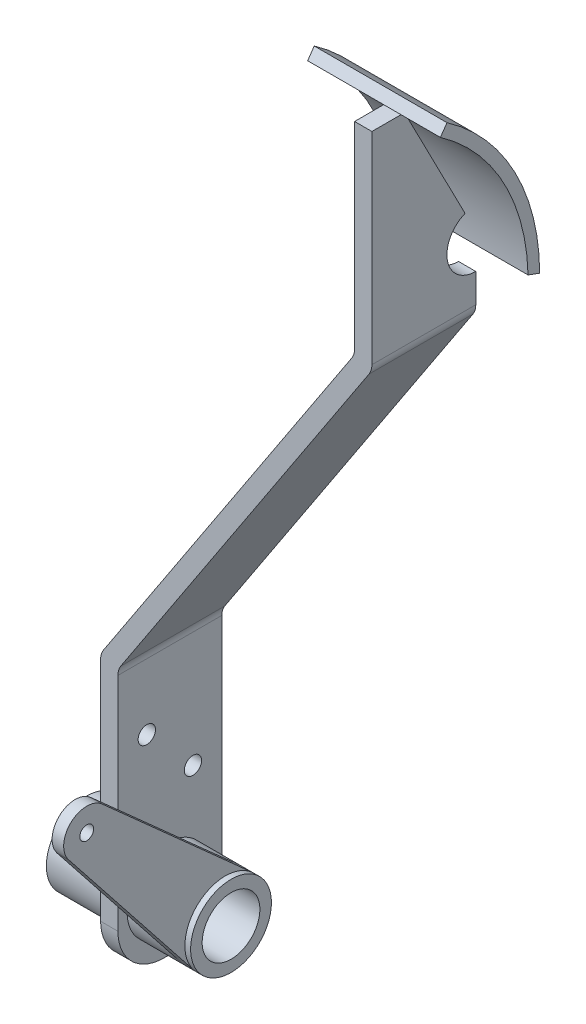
ISO-10303-21;
HEADER;
FILE_DESCRIPTION(('STEP AP214'),'2;1');
FILE_NAME('part.step','',(''),(''),'','','');
FILE_SCHEMA(('AUTOMOTIVE_DESIGN { 1 0 10303 214 1 1 1 1 }'));
ENDSEC;
DATA;
#1=APPLICATION_CONTEXT('core data for automotive mechanical design processes');
#2=APPLICATION_PROTOCOL_DEFINITION('international standard','automotive_design',2000,#1);
#3=PRODUCT_CONTEXT('',#1,'mechanical');
#4=PRODUCT('Part','Part','',(#3));
#5=PRODUCT_RELATED_PRODUCT_CATEGORY('part','',(#4));
#6=PRODUCT_DEFINITION_FORMATION('','',#4);
#7=PRODUCT_DEFINITION_CONTEXT('part definition',#1,'design');
#8=PRODUCT_DEFINITION('design','',#6,#7);
#9=PRODUCT_DEFINITION_SHAPE('','',#8);
#10=(LENGTH_UNIT() NAMED_UNIT(*) SI_UNIT(.MILLI.,.METRE.));
#11=(NAMED_UNIT(*) PLANE_ANGLE_UNIT() SI_UNIT($,.RADIAN.));
#12=(NAMED_UNIT(*) SI_UNIT($,.STERADIAN.) SOLID_ANGLE_UNIT());
#13=UNCERTAINTY_MEASURE_WITH_UNIT(LENGTH_MEASURE(1.E-05),#10,'distance_accuracy_value','');
#14=(GEOMETRIC_REPRESENTATION_CONTEXT(3) GLOBAL_UNCERTAINTY_ASSIGNED_CONTEXT((#13)) GLOBAL_UNIT_ASSIGNED_CONTEXT((#10,
#11,#12)) REPRESENTATION_CONTEXT('',''));
#15=CARTESIAN_POINT('',(0.,0.,0.));
#16=DIRECTION('',(0.,0.,1.));
#17=DIRECTION('',(1.,0.,0.));
#18=AXIS2_PLACEMENT_3D('',#15,#16,#17);
#19=CARTESIAN_POINT('',(57.,124.054513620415,36.4328626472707));
#20=DIRECTION('',(-1.,0.,0.));
#21=DIRECTION('',(0.,0.,1.));
#22=AXIS2_PLACEMENT_3D('',#19,#20,#21);
#23=CYLINDRICAL_SURFACE('',#22,35.5);
#24=DIRECTION('',(-1.,0.,0.));
#25=VECTOR('',#24,1.);
#26=CARTESIAN_POINT('',(57.,153.177217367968,16.1321698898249));
#27=LINE('',#26,#25);
#28=CARTESIAN_POINT('',(57.,153.177217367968,16.1321698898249));
#29=VERTEX_POINT('',#28);
#30=CARTESIAN_POINT('',(34.,153.177217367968,16.1321698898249));
#31=VERTEX_POINT('',#30);
#32=EDGE_CURVE('E98',#29,#31,#27,.T.);
#33=ORIENTED_EDGE('',*,*,#32,.T.);
#34=CARTESIAN_POINT('',(34.,124.054513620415,36.4328626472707));
#35=DIRECTION('',(-1.,0.,0.));
#36=DIRECTION('',(0.,0.,-1.));
#37=AXIS2_PLACEMENT_3D('',#34,#35,#36);
#38=CIRCLE('',#37,35.5);
#39=CARTESIAN_POINT('',(34.,124.938166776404,0.943862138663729));
#40=VERTEX_POINT('',#39);
#41=EDGE_CURVE('E93',#31,#40,#38,.T.);
#42=ORIENTED_EDGE('',*,*,#41,.T.);
#43=DIRECTION('',(-1.,0.,0.));
#44=VECTOR('',#43,1.);
#45=CARTESIAN_POINT('',(57.,124.938166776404,0.943862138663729));
#46=LINE('',#45,#44);
#47=CARTESIAN_POINT('',(57.,124.938166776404,0.943862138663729));
#48=VERTEX_POINT('',#47);
#49=EDGE_CURVE('E12',#48,#40,#46,.T.);
#50=ORIENTED_EDGE('',*,*,#49,.F.);
#51=CARTESIAN_POINT('',(57.,124.054513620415,36.4328626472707));
#52=DIRECTION('',(-1.,0.,0.));
#53=DIRECTION('',(0.,0.,-1.));
#54=AXIS2_PLACEMENT_3D('',#51,#52,#53);
#55=CIRCLE('',#54,35.5);
#56=EDGE_CURVE('E104',#29,#48,#55,.T.);
#57=ORIENTED_EDGE('',*,*,#56,.F.);
#58=EDGE_LOOP('',(#33,#42,#50,#57));
#59=FACE_BOUND('',#58,.T.);
#60=ADVANCED_FACE('F41',(#59),#23,.F.);
#61=CARTESIAN_POINT('',(57.,124.938166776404,0.943862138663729));
#62=DIRECTION('',(0.,0.938562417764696,-0.345109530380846));
#63=DIRECTION('',(0.,0.345109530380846,0.938562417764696));
#64=AXIS2_PLACEMENT_3D('',#61,#62,#63);
#65=PLANE('',#64);
#66=ORIENTED_EDGE('',*,*,#49,.T.);
#67=DIRECTION('',(0.,-0.345109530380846,-0.938562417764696));
#68=VECTOR('',#67,1.);
#69=CARTESIAN_POINT('',(34.,124.938166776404,0.943862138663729));
#70=LINE('',#69,#68);
#71=CARTESIAN_POINT('',(34.,124.198824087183,-1.06685967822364));
#72=VERTEX_POINT('',#71);
#73=EDGE_CURVE('E83',#40,#72,#70,.T.);
#74=ORIENTED_EDGE('',*,*,#73,.T.);
#75=DIRECTION('',(-1.,0.,0.));
#76=VECTOR('',#75,1.);
#77=CARTESIAN_POINT('',(57.,124.198824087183,-1.06685967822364));
#78=LINE('',#77,#76);
#79=CARTESIAN_POINT('',(57.,124.198824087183,-1.06685967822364));
#80=VERTEX_POINT('',#79);
#81=EDGE_CURVE('E48',#80,#72,#78,.T.);
#82=ORIENTED_EDGE('',*,*,#81,.F.);
#83=DIRECTION('',(0.,-0.345109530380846,-0.938562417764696));
#84=VECTOR('',#83,1.);
#85=CARTESIAN_POINT('',(57.,124.938166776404,0.943862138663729));
#86=LINE('',#85,#84);
#87=EDGE_CURVE('E84',#48,#80,#86,.T.);
#88=ORIENTED_EDGE('',*,*,#87,.F.);
#89=EDGE_LOOP('',(#66,#74,#82,#88));
#90=FACE_BOUND('',#89,.T.);
#91=ADVANCED_FACE('F81',(#90),#65,.F.);
#92=CARTESIAN_POINT('',(57.,124.054513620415,36.4328626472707));
#93=DIRECTION('',(-1.,0.,0.));
#94=DIRECTION('',(0.,0.,1.));
#95=AXIS2_PLACEMENT_3D('',#92,#93,#94);
#96=CYLINDRICAL_SURFACE('',#95,37.5);
#97=ORIENTED_EDGE('',*,*,#81,.T.);
#98=CARTESIAN_POINT('',(34.,124.054513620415,36.4328626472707));
#99=DIRECTION('',(1.,0.,0.));
#100=DIRECTION('',(0.,0.,-1.));
#101=AXIS2_PLACEMENT_3D('',#98,#99,#100);
#102=CIRCLE('',#101,37.5);
#103=CARTESIAN_POINT('',(34.,154.817933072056,14.9884688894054));
#104=VERTEX_POINT('',#103);
#105=EDGE_CURVE('E96',#72,#104,#102,.T.);
#106=ORIENTED_EDGE('',*,*,#105,.T.);
#107=DIRECTION('',(-1.,0.,0.));
#108=VECTOR('',#107,1.);
#109=CARTESIAN_POINT('',(57.,154.817933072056,14.9884688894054));
#110=LINE('',#109,#108);
#111=CARTESIAN_POINT('',(57.,154.817933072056,14.9884688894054));
#112=VERTEX_POINT('',#111);
#113=EDGE_CURVE('E110',#112,#104,#110,.T.);
#114=ORIENTED_EDGE('',*,*,#113,.F.);
#115=CARTESIAN_POINT('',(57.,124.054513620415,36.4328626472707));
#116=DIRECTION('',(1.,0.,0.));
#117=DIRECTION('',(0.,0.,-1.));
#118=AXIS2_PLACEMENT_3D('',#115,#116,#117);
#119=CIRCLE('',#118,37.5);
#120=EDGE_CURVE('E60',#80,#112,#119,.T.);
#121=ORIENTED_EDGE('',*,*,#120,.F.);
#122=EDGE_LOOP('',(#97,#106,#114,#121));
#123=FACE_BOUND('',#122,.T.);
#124=ADVANCED_FACE('F112',(#123),#96,.T.);
#125=CARTESIAN_POINT('',(57.,153.177217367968,16.1321698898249));
#126=DIRECTION('',(0.,-0.571850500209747,-0.820357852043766));
#127=DIRECTION('',(0.,0.820357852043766,-0.571850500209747));
#128=AXIS2_PLACEMENT_3D('',#125,#126,#127);
#129=PLANE('',#128);
#130=ORIENTED_EDGE('',*,*,#113,.T.);
#131=DIRECTION('',(0.,-0.820357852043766,0.571850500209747));
#132=VECTOR('',#131,1.);
#133=CARTESIAN_POINT('',(34.,153.177217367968,16.1321698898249));
#134=LINE('',#133,#132);
#135=EDGE_CURVE('E102',#104,#31,#134,.T.);
#136=ORIENTED_EDGE('',*,*,#135,.T.);
#137=ORIENTED_EDGE('',*,*,#32,.F.);
#138=DIRECTION('',(0.,-0.820357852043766,0.571850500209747));
#139=VECTOR('',#138,1.);
#140=CARTESIAN_POINT('',(57.,153.177217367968,16.1321698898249));
#141=LINE('',#140,#139);
#142=EDGE_CURVE('E55',#112,#29,#141,.T.);
#143=ORIENTED_EDGE('',*,*,#142,.F.);
#144=EDGE_LOOP('',(#130,#136,#137,#143));
#145=FACE_BOUND('',#144,.T.);
#146=ADVANCED_FACE('F114',(#145),#129,.F.);
#147=CARTESIAN_POINT('',(57.,124.054513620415,36.4328626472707));
#148=DIRECTION('',(1.,0.,0.));
#149=DIRECTION('',(0.,0.,-1.));
#150=AXIS2_PLACEMENT_3D('',#147,#148,#149);
#151=PLANE('',#150);
#152=ORIENTED_EDGE('',*,*,#56,.T.);
#153=ORIENTED_EDGE('',*,*,#87,.T.);
#154=ORIENTED_EDGE('',*,*,#120,.T.);
#155=ORIENTED_EDGE('',*,*,#142,.T.);
#156=EDGE_LOOP('',(#152,#153,#154,#155));
#157=FACE_BOUND('',#156,.T.);
#158=ADVANCED_FACE('F115',(#157),#151,.T.);
#159=CARTESIAN_POINT('',(34.,124.054513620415,36.4328626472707));
#160=DIRECTION('',(1.,0.,0.));
#161=DIRECTION('',(0.,0.,-1.));
#162=AXIS2_PLACEMENT_3D('',#159,#160,#161);
#163=PLANE('',#162);
#164=ORIENTED_EDGE('',*,*,#41,.F.);
#165=ORIENTED_EDGE('',*,*,#135,.F.);
#166=ORIENTED_EDGE('',*,*,#105,.F.);
#167=ORIENTED_EDGE('',*,*,#73,.F.);
#168=EDGE_LOOP('',(#164,#165,#166,#167));
#169=FACE_BOUND('',#168,.T.);
#170=ADVANCED_FACE('F91',(#169),#163,.F.);
#171=CLOSED_SHELL('',(#60,#91,#124,#146,#158,#170));
#172=MANIFOLD_SOLID_BREP('B2',#171);
#173=CARTESIAN_POINT('',(14.,10.,9.40390545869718));
#174=DIRECTION('',(-1.,0.,0.));
#175=DIRECTION('',(0.,0.,1.));
#176=AXIS2_PLACEMENT_3D('',#173,#174,#175);
#177=CYLINDRICAL_SURFACE('',#176,7.);
#178=CARTESIAN_POINT('',(3.,10.,9.40390545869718));
#179=DIRECTION('',(1.,0.,0.));
#180=DIRECTION('',(0.,0.,-1.));
#181=AXIS2_PLACEMENT_3D('',#178,#179,#180);
#182=CIRCLE('',#181,7.);
#183=CARTESIAN_POINT('',(3.,10.,2.40390545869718));
#184=VERTEX_POINT('',#183);
#185=EDGE_CURVE('E346',#184,#184,#182,.T.);
#186=ORIENTED_EDGE('',*,*,#185,.T.);
#187=EDGE_LOOP('',(#186));
#188=FACE_BOUND('',#187,.T.);
#189=CARTESIAN_POINT('',(14.,10.,9.40390545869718));
#190=DIRECTION('',(1.,0.,0.));
#191=DIRECTION('',(0.,0.,-1.));
#192=AXIS2_PLACEMENT_3D('',#189,#190,#191);
#193=CIRCLE('',#192,7.);
#194=CARTESIAN_POINT('',(14.,10.,2.40390545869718));
#195=VERTEX_POINT('',#194);
#196=EDGE_CURVE('E340',#195,#195,#193,.T.);
#197=ORIENTED_EDGE('',*,*,#196,.F.);
#198=EDGE_LOOP('',(#197));
#199=FACE_BOUND('',#198,.T.);
#200=DIRECTION('',(-1.,0.,0.));
#201=VECTOR('',#200,1.);
#202=CARTESIAN_POINT('',(13.,15.2190573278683,4.73898953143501));
#203=LINE('',#202,#201);
#204=CARTESIAN_POINT('',(13.,15.2190573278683,4.73898953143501));
#205=VERTEX_POINT('',#204);
#206=CARTESIAN_POINT('',(11.,15.2190573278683,4.73898953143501));
#207=VERTEX_POINT('',#206);
#208=EDGE_CURVE('E308',#205,#207,#203,.T.);
#209=ORIENTED_EDGE('',*,*,#208,.F.);
#210=CARTESIAN_POINT('',(13.,10.,9.40390545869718));
#211=DIRECTION('',(-1.,0.,0.));
#212=DIRECTION('',(0.,0.,-1.));
#213=AXIS2_PLACEMENT_3D('',#210,#211,#212);
#214=CIRCLE('',#213,7.);
#215=CARTESIAN_POINT('',(13.,5.6543876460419,14.8916785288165));
#216=VERTEX_POINT('',#215);
#217=EDGE_CURVE('E314',#216,#205,#214,.T.);
#218=ORIENTED_EDGE('',*,*,#217,.F.);
#219=DIRECTION('',(-1.,0.,0.));
#220=VECTOR('',#219,1.);
#221=CARTESIAN_POINT('',(13.,5.6543876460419,14.8916785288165));
#222=LINE('',#221,#220);
#223=CARTESIAN_POINT('',(11.,5.6543876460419,14.8916785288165));
#224=VERTEX_POINT('',#223);
#225=EDGE_CURVE('E584',#216,#224,#222,.T.);
#226=ORIENTED_EDGE('',*,*,#225,.T.);
#227=CARTESIAN_POINT('',(11.,10.,9.40390545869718));
#228=DIRECTION('',(-1.,0.,0.));
#229=DIRECTION('',(0.,0.,-1.));
#230=AXIS2_PLACEMENT_3D('',#227,#228,#229);
#231=CIRCLE('',#230,7.);
#232=EDGE_CURVE('E180',#224,#207,#231,.T.);
#233=ORIENTED_EDGE('',*,*,#232,.T.);
#234=EDGE_LOOP('',(#209,#218,#226,#233));
#235=FACE_BOUND('',#234,.T.);
#236=ADVANCED_FACE('F165',(#188,#199,#235),#177,.T.);
#237=CARTESIAN_POINT('',(47.,115.,18.));
#238=DIRECTION('',(-1.,0.,0.));
#239=DIRECTION('',(0.,0.,1.));
#240=AXIS2_PLACEMENT_3D('',#237,#238,#239);
#241=PLANE('',#240);
#242=DIRECTION('',(0.,1.,0.));
#243=VECTOR('',#242,1.);
#244=CARTESIAN_POINT('',(47.,115.,0.));
#245=LINE('',#244,#243);
#246=CARTESIAN_POINT('',(47.,115.,0.));
#247=VERTEX_POINT('',#246);
#248=CARTESIAN_POINT('',(47.,120.,0.));
#249=VERTEX_POINT('',#248);
#250=EDGE_CURVE('E364',#247,#249,#245,.T.);
#251=ORIENTED_EDGE('',*,*,#250,.T.);
#252=CARTESIAN_POINT('',(47.,125.,0.));
#253=DIRECTION('',(1.,0.,0.));
#254=DIRECTION('',(0.,0.,-1.));
#255=AXIS2_PLACEMENT_3D('',#252,#253,#254);
#256=CIRCLE('',#255,5.);
#257=CARTESIAN_POINT('',(47.,129.64258533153,1.85644860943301));
#258=VERTEX_POINT('',#257);
#259=EDGE_CURVE('E349',#258,#249,#256,.T.);
#260=ORIENTED_EDGE('',*,*,#259,.F.);
#261=DIRECTION('',(0.,-0.888698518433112,-0.45849203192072));
#262=VECTOR('',#261,1.);
#263=CARTESIAN_POINT('',(47.,124.655960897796,-0.716220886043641));
#264=LINE('',#263,#262);
#265=CARTESIAN_POINT('',(47.,150.,12.3591244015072));
#266=VERTEX_POINT('',#265);
#267=EDGE_CURVE('E361',#266,#258,#264,.T.);
#268=ORIENTED_EDGE('',*,*,#267,.F.);
#269=DIRECTION('',(0.,0.,-1.));
#270=VECTOR('',#269,1.);
#271=CARTESIAN_POINT('',(47.,150.,18.));
#272=LINE('',#271,#270);
#273=CARTESIAN_POINT('',(47.,150.,18.));
#274=VERTEX_POINT('',#273);
#275=EDGE_CURVE('E405',#274,#266,#272,.T.);
#276=ORIENTED_EDGE('',*,*,#275,.F.);
#277=DIRECTION('',(0.,1.,0.));
#278=VECTOR('',#277,1.);
#279=CARTESIAN_POINT('',(47.,115.,18.));
#280=LINE('',#279,#278);
#281=CARTESIAN_POINT('',(47.,115.,18.));
#282=VERTEX_POINT('',#281);
#283=EDGE_CURVE('E365',#282,#274,#280,.T.);
#284=ORIENTED_EDGE('',*,*,#283,.F.);
#285=DIRECTION('',(0.,0.,-1.));
#286=VECTOR('',#285,1.);
#287=CARTESIAN_POINT('',(47.,115.,18.));
#288=LINE('',#287,#286);
#289=EDGE_CURVE('E408',#282,#247,#288,.T.);
#290=ORIENTED_EDGE('',*,*,#289,.T.);
#291=EDGE_LOOP('',(#251,#260,#268,#276,#284,#290));
#292=FACE_BOUND('',#291,.T.);
#293=ADVANCED_FACE('F501',(#292),#241,.F.);
#294=CARTESIAN_POINT('',(44.,150.,18.));
#295=DIRECTION('',(0.,1.,0.));
#296=DIRECTION('',(0.,0.,1.));
#297=AXIS2_PLACEMENT_3D('',#294,#295,#296);
#298=PLANE('',#297);
#299=ORIENTED_EDGE('',*,*,#275,.T.);
#300=DIRECTION('',(-1.,0.,0.));
#301=VECTOR('',#300,1.);
#302=CARTESIAN_POINT('',(44.,150.,12.3591244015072));
#303=LINE('',#302,#301);
#304=CARTESIAN_POINT('',(44.,150.,12.3591244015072));
#305=VERTEX_POINT('',#304);
#306=EDGE_CURVE('E358',#266,#305,#303,.T.);
#307=ORIENTED_EDGE('',*,*,#306,.T.);
#308=DIRECTION('',(0.,0.,-1.));
#309=VECTOR('',#308,1.);
#310=CARTESIAN_POINT('',(44.,150.,18.));
#311=LINE('',#310,#309);
#312=CARTESIAN_POINT('',(44.,150.,18.));
#313=VERTEX_POINT('',#312);
#314=EDGE_CURVE('E402',#313,#305,#311,.T.);
#315=ORIENTED_EDGE('',*,*,#314,.F.);
#316=DIRECTION('',(1.,0.,0.));
#317=VECTOR('',#316,1.);
#318=CARTESIAN_POINT('',(44.,150.,18.));
#319=LINE('',#318,#317);
#320=EDGE_CURVE('E367',#313,#274,#319,.T.);
#321=ORIENTED_EDGE('',*,*,#320,.T.);
#322=EDGE_LOOP('',(#299,#307,#315,#321));
#323=FACE_BOUND('',#322,.T.);
#324=ADVANCED_FACE('F507',(#323),#298,.T.);
#325=CARTESIAN_POINT('',(44.,115.,18.));
#326=DIRECTION('',(-1.,0.,0.));
#327=DIRECTION('',(0.,0.,1.));
#328=AXIS2_PLACEMENT_3D('',#325,#326,#327);
#329=PLANE('',#328);
#330=CARTESIAN_POINT('',(44.,125.,0.));
#331=DIRECTION('',(-1.,0.,0.));
#332=DIRECTION('',(0.,0.,1.));
#333=AXIS2_PLACEMENT_3D('',#330,#331,#332);
#334=CIRCLE('',#333,5.);
#335=CARTESIAN_POINT('',(44.,120.,0.));
#336=VERTEX_POINT('',#335);
#337=CARTESIAN_POINT('',(44.,129.64258533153,1.856448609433));
#338=VERTEX_POINT('',#337);
#339=EDGE_CURVE('E351',#336,#338,#334,.T.);
#340=ORIENTED_EDGE('',*,*,#339,.F.);
#341=DIRECTION('',(0.,1.,0.));
#342=VECTOR('',#341,1.);
#343=CARTESIAN_POINT('',(44.,115.,0.));
#344=LINE('',#343,#342);
#345=CARTESIAN_POINT('',(44.,115.899101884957,0.));
#346=VERTEX_POINT('',#345);
#347=EDGE_CURVE('E386',#346,#336,#344,.T.);
#348=ORIENTED_EDGE('',*,*,#347,.F.);
#349=DIRECTION('',(0.,0.,-1.));
#350=VECTOR('',#349,1.);
#351=CARTESIAN_POINT('',(44.,115.899101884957,18.));
#352=LINE('',#351,#350);
#353=CARTESIAN_POINT('',(44.,115.899101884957,18.));
#354=VERTEX_POINT('',#353);
#355=EDGE_CURVE('E430',#346,#354,#352,.F.);
#356=ORIENTED_EDGE('',*,*,#355,.T.);
#357=DIRECTION('',(0.,1.,0.));
#358=VECTOR('',#357,1.);
#359=CARTESIAN_POINT('',(44.,115.,18.));
#360=LINE('',#359,#358);
#361=EDGE_CURVE('E371',#354,#313,#360,.T.);
#362=ORIENTED_EDGE('',*,*,#361,.T.);
#363=ORIENTED_EDGE('',*,*,#314,.T.);
#364=DIRECTION('',(0.,-0.888698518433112,-0.45849203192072));
#365=VECTOR('',#364,1.);
#366=CARTESIAN_POINT('',(44.,124.655960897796,-0.716220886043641));
#367=LINE('',#366,#365);
#368=EDGE_CURVE('E355',#305,#338,#367,.T.);
#369=ORIENTED_EDGE('',*,*,#368,.T.);
#370=EDGE_LOOP('',(#340,#348,#356,#362,#363,#369));
#371=FACE_BOUND('',#370,.T.);
#372=ADVANCED_FACE('F615',(#371),#329,.T.);
#373=CARTESIAN_POINT('',(47.,150.,0.));
#374=DIRECTION('',(0.,0.,-1.));
#375=DIRECTION('',(-1.,0.,0.));
#376=AXIS2_PLACEMENT_3D('',#373,#374,#375);
#377=PLANE('',#376);
#378=DIRECTION('',(0.,1.,0.));
#379=VECTOR('',#378,1.);
#380=CARTESIAN_POINT('',(3.,0.,0.));
#381=LINE('',#380,#379);
#382=CARTESIAN_POINT('',(3.,8.00000000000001,0.));
#383=VERTEX_POINT('',#382);
#384=CARTESIAN_POINT('',(3.,46.3886238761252,0.));
#385=VERTEX_POINT('',#384);
#386=EDGE_CURVE('E394',#383,#385,#381,.T.);
#387=ORIENTED_EDGE('',*,*,#386,.F.);
#388=DIRECTION('',(-1.,0.,0.));
#389=VECTOR('',#388,1.);
#390=CARTESIAN_POINT('',(47.,8.00000000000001,0.));
#391=LINE('',#390,#389);
#392=CARTESIAN_POINT('',(0.,8.00000000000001,0.));
#393=VERTEX_POINT('',#392);
#394=EDGE_CURVE('E39',#383,#393,#391,.T.);
#395=ORIENTED_EDGE('',*,*,#394,.T.);
#396=DIRECTION('',(0.,1.,0.));
#397=VECTOR('',#396,1.);
#398=CARTESIAN_POINT('',(0.,0.,0.));
#399=LINE('',#398,#397);
#400=CARTESIAN_POINT('',(0.,47.2877257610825,0.));
#401=VERTEX_POINT('',#400);
#402=EDGE_CURVE('E392',#393,#401,#399,.T.);
#403=ORIENTED_EDGE('',*,*,#402,.T.);
#404=CARTESIAN_POINT('',(3.,47.2877257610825,0.));
#405=DIRECTION('',(0.,0.,-1.));
#406=DIRECTION('',(-1.,0.,0.));
#407=AXIS2_PLACEMENT_3D('',#404,#405,#406);
#408=CIRCLE('',#407,3.);
#409=CARTESIAN_POINT('',(0.494506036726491,48.9377257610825,0.));
#410=VERTEX_POINT('',#409);
#411=EDGE_CURVE('E411',#401,#410,#408,.T.);
#412=ORIENTED_EDGE('',*,*,#411,.T.);
#413=DIRECTION('',(0.55,0.835164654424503,0.));
#414=VECTOR('',#413,1.);
#415=CARTESIAN_POINT('',(0.,48.1868276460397,0.));
#416=LINE('',#415,#414);
#417=CARTESIAN_POINT('',(43.5054939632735,114.249101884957,0.));
#418=VERTEX_POINT('',#417);
#419=EDGE_CURVE('E389',#410,#418,#416,.T.);
#420=ORIENTED_EDGE('',*,*,#419,.T.);
#421=CARTESIAN_POINT('',(41.,115.899101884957,0.));
#422=DIRECTION('',(0.,0.,-1.));
#423=DIRECTION('',(-1.,0.,0.));
#424=AXIS2_PLACEMENT_3D('',#421,#422,#423);
#425=CIRCLE('',#424,3.);
#426=EDGE_CURVE('E438',#418,#346,#425,.F.);
#427=ORIENTED_EDGE('',*,*,#426,.T.);
#428=ORIENTED_EDGE('',*,*,#347,.T.);
#429=DIRECTION('',(1.,0.,0.));
#430=VECTOR('',#429,1.);
#431=CARTESIAN_POINT('',(0.,120.,0.));
#432=LINE('',#431,#430);
#433=EDGE_CURVE('E353',#249,#336,#432,.F.);
#434=ORIENTED_EDGE('',*,*,#433,.F.);
#435=ORIENTED_EDGE('',*,*,#250,.F.);
#436=CARTESIAN_POINT('',(44.,115.,0.));
#437=DIRECTION('',(0.,0.,-1.));
#438=DIRECTION('',(-1.,0.,0.));
#439=AXIS2_PLACEMENT_3D('',#436,#437,#438);
#440=CIRCLE('',#439,3.);
#441=CARTESIAN_POINT('',(46.5054939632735,113.35,0.));
#442=VERTEX_POINT('',#441);
#443=EDGE_CURVE('E413',#247,#442,#440,.T.);
#444=ORIENTED_EDGE('',*,*,#443,.T.);
#445=DIRECTION('',(0.55,0.835164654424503,0.));
#446=VECTOR('',#445,1.);
#447=CARTESIAN_POINT('',(2.50549396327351,46.5368276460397,0.));
#448=LINE('',#447,#446);
#449=CARTESIAN_POINT('',(3.49450603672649,48.0386238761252,0.));
#450=VERTEX_POINT('',#449);
#451=EDGE_CURVE('E368',#450,#442,#448,.T.);
#452=ORIENTED_EDGE('',*,*,#451,.F.);
#453=CARTESIAN_POINT('',(6.,46.3886238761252,0.));
#454=DIRECTION('',(0.,0.,-1.));
#455=DIRECTION('',(-1.,0.,0.));
#456=AXIS2_PLACEMENT_3D('',#453,#454,#455);
#457=CIRCLE('',#456,3.);
#458=EDGE_CURVE('E442',#450,#385,#457,.F.);
#459=ORIENTED_EDGE('',*,*,#458,.T.);
#460=EDGE_LOOP('',(#387,#395,#403,#412,#420,#427,#428,#434,#435,#444,#452,#459));
#461=FACE_BOUND('',#460,.T.);
#462=ADVANCED_FACE('F486',(#461),#377,.T.);
#463=CARTESIAN_POINT('',(0.,48.1868276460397,18.));
#464=DIRECTION('',(-0.835164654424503,0.55,0.));
#465=DIRECTION('',(-0.55,-0.835164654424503,0.));
#466=AXIS2_PLACEMENT_3D('',#463,#464,#465);
#467=PLANE('',#466);
#468=DIRECTION('',(0.55,0.835164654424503,0.));
#469=VECTOR('',#468,1.);
#470=CARTESIAN_POINT('',(0.,48.1868276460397,18.));
#471=LINE('',#470,#469);
#472=CARTESIAN_POINT('',(0.494506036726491,48.9377257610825,18.));
#473=VERTEX_POINT('',#472);
#474=CARTESIAN_POINT('',(43.5054939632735,114.249101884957,18.));
#475=VERTEX_POINT('',#474);
#476=EDGE_CURVE('E373',#473,#475,#471,.T.);
#477=ORIENTED_EDGE('',*,*,#476,.T.);
#478=DIRECTION('',(0.,0.,-1.));
#479=VECTOR('',#478,1.);
#480=CARTESIAN_POINT('',(43.5054939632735,114.249101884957,0.));
#481=LINE('',#480,#479);
#482=EDGE_CURVE('E427',#475,#418,#481,.T.);
#483=ORIENTED_EDGE('',*,*,#482,.T.);
#484=ORIENTED_EDGE('',*,*,#419,.F.);
#485=DIRECTION('',(0.,0.,-1.));
#486=VECTOR('',#485,1.);
#487=CARTESIAN_POINT('',(0.494506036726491,48.9377257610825,18.));
#488=LINE('',#487,#486);
#489=EDGE_CURVE('E425',#410,#473,#488,.F.);
#490=ORIENTED_EDGE('',*,*,#489,.T.);
#491=EDGE_LOOP('',(#477,#483,#484,#490));
#492=FACE_BOUND('',#491,.T.);
#493=ADVANCED_FACE('F603',(#492),#467,.T.);
#494=CARTESIAN_POINT('',(0.,0.,18.));
#495=DIRECTION('',(-1.,0.,0.));
#496=DIRECTION('',(0.,0.,1.));
#497=AXIS2_PLACEMENT_3D('',#494,#495,#496);
#498=PLANE('',#497);
#499=CARTESIAN_POINT('',(0.,26.3886238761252,5.));
#500=DIRECTION('',(-1.,0.,0.));
#501=DIRECTION('',(0.,0.,1.));
#502=AXIS2_PLACEMENT_3D('',#499,#500,#501);
#503=CIRCLE('',#502,1.5);
#504=CARTESIAN_POINT('',(0.,26.3886238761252,3.5));
#505=VERTEX_POINT('',#504);
#506=EDGE_CURVE('E562',#505,#505,#503,.T.);
#507=ORIENTED_EDGE('',*,*,#506,.F.);
#508=EDGE_LOOP('',(#507));
#509=FACE_BOUND('',#508,.T.);
#510=CARTESIAN_POINT('',(0.,35.,13.));
#511=DIRECTION('',(-1.,0.,0.));
#512=DIRECTION('',(0.,0.,1.));
#513=AXIS2_PLACEMENT_3D('',#510,#511,#512);
#514=CIRCLE('',#513,1.5);
#515=CARTESIAN_POINT('',(0.,35.,11.5));
#516=VERTEX_POINT('',#515);
#517=EDGE_CURVE('E573',#516,#516,#514,.T.);
#518=ORIENTED_EDGE('',*,*,#517,.F.);
#519=EDGE_LOOP('',(#518));
#520=FACE_BOUND('',#519,.T.);
#521=CARTESIAN_POINT('',(0.,10.,9.40390545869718));
#522=DIRECTION('',(-1.,0.,0.));
#523=DIRECTION('',(0.,0.,1.));
#524=AXIS2_PLACEMENT_3D('',#521,#522,#523);
#525=CIRCLE('',#524,7.);
#526=CARTESIAN_POINT('',(0.,10.,16.4039054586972));
#527=VERTEX_POINT('',#526);
#528=EDGE_CURVE('E343',#527,#527,#525,.F.);
#529=ORIENTED_EDGE('',*,*,#528,.T.);
#530=EDGE_LOOP('',(#529));
#531=FACE_BOUND('',#530,.T.);
#532=DIRECTION('',(0.,0.,-1.));
#533=VECTOR('',#532,1.);
#534=CARTESIAN_POINT('',(0.,0.,18.));
#535=LINE('',#534,#533);
#536=CARTESIAN_POINT('',(0.,0.,10.));
#537=VERTEX_POINT('',#536);
#538=CARTESIAN_POINT('',(0.,0.,8.));
#539=VERTEX_POINT('',#538);
#540=EDGE_CURVE('E399',#537,#539,#535,.T.);
#541=ORIENTED_EDGE('',*,*,#540,.F.);
#542=CARTESIAN_POINT('',(0.,8.,10.));
#543=DIRECTION('',(-1.,0.,0.));
#544=DIRECTION('',(0.,0.,1.));
#545=AXIS2_PLACEMENT_3D('',#542,#543,#544);
#546=CIRCLE('',#545,8.);
#547=CARTESIAN_POINT('',(0.,8.,18.));
#548=VERTEX_POINT('',#547);
#549=EDGE_CURVE('E456',#537,#548,#546,.T.);
#550=ORIENTED_EDGE('',*,*,#549,.T.);
#551=DIRECTION('',(0.,1.,0.));
#552=VECTOR('',#551,1.);
#553=CARTESIAN_POINT('',(0.,0.,18.));
#554=LINE('',#553,#552);
#555=CARTESIAN_POINT('',(0.,47.2877257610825,18.));
#556=VERTEX_POINT('',#555);
#557=EDGE_CURVE('E376',#548,#556,#554,.T.);
#558=ORIENTED_EDGE('',*,*,#557,.T.);
#559=DIRECTION('',(0.,0.,-1.));
#560=VECTOR('',#559,1.);
#561=CARTESIAN_POINT('',(0.,47.2877257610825,18.));
#562=LINE('',#561,#560);
#563=EDGE_CURVE('E432',#556,#401,#562,.T.);
#564=ORIENTED_EDGE('',*,*,#563,.T.);
#565=ORIENTED_EDGE('',*,*,#402,.F.);
#566=CARTESIAN_POINT('',(0.,8.00000000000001,8.));
#567=DIRECTION('',(-1.,0.,0.));
#568=DIRECTION('',(0.,0.,1.));
#569=AXIS2_PLACEMENT_3D('',#566,#567,#568);
#570=CIRCLE('',#569,8.);
#571=EDGE_CURVE('E454',#393,#539,#570,.T.);
#572=ORIENTED_EDGE('',*,*,#571,.T.);
#573=EDGE_LOOP('',(#541,#550,#558,#564,#565,#572));
#574=FACE_BOUND('',#573,.T.);
#575=ADVANCED_FACE('F474',(#509,#520,#531,#574),#498,.T.);
#576=CARTESIAN_POINT('',(3.,0.,18.));
#577=DIRECTION('',(0.,-1.,0.));
#578=DIRECTION('',(0.,0.,-1.));
#579=AXIS2_PLACEMENT_3D('',#576,#577,#578);
#580=PLANE('',#579);
#581=DIRECTION('',(0.,0.,-1.));
#582=VECTOR('',#581,1.);
#583=CARTESIAN_POINT('',(3.,0.,18.));
#584=LINE('',#583,#582);
#585=CARTESIAN_POINT('',(3.,0.,10.));
#586=VERTEX_POINT('',#585);
#587=CARTESIAN_POINT('',(3.,0.,8.));
#588=VERTEX_POINT('',#587);
#589=EDGE_CURVE('E383',#586,#588,#584,.T.);
#590=ORIENTED_EDGE('',*,*,#589,.F.);
#591=DIRECTION('',(-1.,0.,0.));
#592=VECTOR('',#591,1.);
#593=CARTESIAN_POINT('',(0.,0.,10.));
#594=LINE('',#593,#592);
#595=EDGE_CURVE('E451',#586,#537,#594,.T.);
#596=ORIENTED_EDGE('',*,*,#595,.T.);
#597=ORIENTED_EDGE('',*,*,#540,.T.);
#598=DIRECTION('',(-1.,0.,0.));
#599=VECTOR('',#598,1.);
#600=CARTESIAN_POINT('',(3.,0.,8.));
#601=LINE('',#600,#599);
#602=EDGE_CURVE('E449',#539,#588,#601,.F.);
#603=ORIENTED_EDGE('',*,*,#602,.T.);
#604=EDGE_LOOP('',(#590,#596,#597,#603));
#605=FACE_BOUND('',#604,.T.);
#606=ADVANCED_FACE('F468',(#605),#580,.T.);
#607=CARTESIAN_POINT('',(3.,0.,18.));
#608=DIRECTION('',(-1.,0.,0.));
#609=DIRECTION('',(0.,0.,1.));
#610=AXIS2_PLACEMENT_3D('',#607,#608,#609);
#611=PLANE('',#610);
#612=CARTESIAN_POINT('',(3.,26.3886238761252,5.));
#613=DIRECTION('',(1.,0.,0.));
#614=DIRECTION('',(0.,0.,-1.));
#615=AXIS2_PLACEMENT_3D('',#612,#613,#614);
#616=CIRCLE('',#615,1.5);
#617=CARTESIAN_POINT('',(3.,26.3886238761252,3.5));
#618=VERTEX_POINT('',#617);
#619=EDGE_CURVE('E565',#618,#618,#616,.T.);
#620=ORIENTED_EDGE('',*,*,#619,.F.);
#621=EDGE_LOOP('',(#620));
#622=FACE_BOUND('',#621,.T.);
#623=CARTESIAN_POINT('',(3.,35.,13.));
#624=DIRECTION('',(1.,0.,0.));
#625=DIRECTION('',(0.,0.,-1.));
#626=AXIS2_PLACEMENT_3D('',#623,#624,#625);
#627=CIRCLE('',#626,1.5);
#628=CARTESIAN_POINT('',(3.,35.,11.5));
#629=VERTEX_POINT('',#628);
#630=EDGE_CURVE('E568',#629,#629,#627,.T.);
#631=ORIENTED_EDGE('',*,*,#630,.F.);
#632=EDGE_LOOP('',(#631));
#633=FACE_BOUND('',#632,.T.);
#634=ORIENTED_EDGE('',*,*,#185,.F.);
#635=EDGE_LOOP('',(#634));
#636=FACE_BOUND('',#635,.T.);
#637=DIRECTION('',(0.,1.,0.));
#638=VECTOR('',#637,1.);
#639=CARTESIAN_POINT('',(3.,0.,18.));
#640=LINE('',#639,#638);
#641=CARTESIAN_POINT('',(3.,8.,18.));
#642=VERTEX_POINT('',#641);
#643=CARTESIAN_POINT('',(3.,46.3886238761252,18.));
#644=VERTEX_POINT('',#643);
#645=EDGE_CURVE('E378',#642,#644,#640,.T.);
#646=ORIENTED_EDGE('',*,*,#645,.F.);
#647=CARTESIAN_POINT('',(3.,8.,10.));
#648=DIRECTION('',(-1.,0.,0.));
#649=DIRECTION('',(0.,0.,1.));
#650=AXIS2_PLACEMENT_3D('',#647,#648,#649);
#651=CIRCLE('',#650,8.);
#652=EDGE_CURVE('E173',#642,#586,#651,.F.);
#653=ORIENTED_EDGE('',*,*,#652,.T.);
#654=ORIENTED_EDGE('',*,*,#589,.T.);
#655=CARTESIAN_POINT('',(3.,8.00000000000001,8.));
#656=DIRECTION('',(-1.,0.,0.));
#657=DIRECTION('',(0.,0.,1.));
#658=AXIS2_PLACEMENT_3D('',#655,#656,#657);
#659=CIRCLE('',#658,8.);
#660=EDGE_CURVE('E188',#588,#383,#659,.F.);
#661=ORIENTED_EDGE('',*,*,#660,.T.);
#662=ORIENTED_EDGE('',*,*,#386,.T.);
#663=DIRECTION('',(0.,0.,-1.));
#664=VECTOR('',#663,1.);
#665=CARTESIAN_POINT('',(3.,46.3886238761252,18.));
#666=LINE('',#665,#664);
#667=EDGE_CURVE('E435',#385,#644,#666,.F.);
#668=ORIENTED_EDGE('',*,*,#667,.T.);
#669=EDGE_LOOP('',(#646,#653,#654,#661,#662,#668));
#670=FACE_BOUND('',#669,.T.);
#671=ADVANCED_FACE('F463',(#622,#633,#636,#670),#611,.F.);
#672=CARTESIAN_POINT('',(2.50549396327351,46.5368276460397,18.));
#673=DIRECTION('',(-0.835164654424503,0.55,0.));
#674=DIRECTION('',(-0.55,-0.835164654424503,0.));
#675=AXIS2_PLACEMENT_3D('',#672,#673,#674);
#676=PLANE('',#675);
#677=ORIENTED_EDGE('',*,*,#451,.T.);
#678=DIRECTION('',(0.,0.,-1.));
#679=VECTOR('',#678,1.);
#680=CARTESIAN_POINT('',(46.5054939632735,113.35,18.));
#681=LINE('',#680,#679);
#682=CARTESIAN_POINT('',(46.5054939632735,113.35,18.));
#683=VERTEX_POINT('',#682);
#684=EDGE_CURVE('E418',#442,#683,#681,.F.);
#685=ORIENTED_EDGE('',*,*,#684,.T.);
#686=DIRECTION('',(0.55,0.835164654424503,0.));
#687=VECTOR('',#686,1.);
#688=CARTESIAN_POINT('',(2.50549396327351,46.5368276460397,18.));
#689=LINE('',#688,#687);
#690=CARTESIAN_POINT('',(3.49450603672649,48.0386238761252,18.));
#691=VERTEX_POINT('',#690);
#692=EDGE_CURVE('E380',#691,#683,#689,.T.);
#693=ORIENTED_EDGE('',*,*,#692,.F.);
#694=DIRECTION('',(0.,0.,-1.));
#695=VECTOR('',#694,1.);
#696=CARTESIAN_POINT('',(3.49450603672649,48.0386238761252,0.));
#697=LINE('',#696,#695);
#698=EDGE_CURVE('E415',#691,#450,#697,.T.);
#699=ORIENTED_EDGE('',*,*,#698,.T.);
#700=EDGE_LOOP('',(#677,#685,#693,#699));
#701=FACE_BOUND('',#700,.T.);
#702=ADVANCED_FACE('F647',(#701),#676,.F.);
#703=CARTESIAN_POINT('',(47.,150.,18.));
#704=DIRECTION('',(0.,0.,-1.));
#705=DIRECTION('',(-1.,0.,0.));
#706=AXIS2_PLACEMENT_3D('',#703,#704,#705);
#707=PLANE('',#706);
#708=ORIENTED_EDGE('',*,*,#557,.F.);
#709=DIRECTION('',(-1.,0.,0.));
#710=VECTOR('',#709,1.);
#711=CARTESIAN_POINT('',(3.,8.,18.));
#712=LINE('',#711,#710);
#713=EDGE_CURVE('E458',#548,#642,#712,.F.);
#714=ORIENTED_EDGE('',*,*,#713,.T.);
#715=ORIENTED_EDGE('',*,*,#645,.T.);
#716=CARTESIAN_POINT('',(6.,46.3886238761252,18.));
#717=DIRECTION('',(0.,0.,-1.));
#718=DIRECTION('',(-1.,0.,0.));
#719=AXIS2_PLACEMENT_3D('',#716,#717,#718);
#720=CIRCLE('',#719,3.);
#721=EDGE_CURVE('E445',#644,#691,#720,.T.);
#722=ORIENTED_EDGE('',*,*,#721,.T.);
#723=ORIENTED_EDGE('',*,*,#692,.T.);
#724=CARTESIAN_POINT('',(44.,115.,18.));
#725=DIRECTION('',(0.,0.,-1.));
#726=DIRECTION('',(-1.,0.,0.));
#727=AXIS2_PLACEMENT_3D('',#724,#725,#726);
#728=CIRCLE('',#727,3.);
#729=EDGE_CURVE('E423',#683,#282,#728,.F.);
#730=ORIENTED_EDGE('',*,*,#729,.T.);
#731=ORIENTED_EDGE('',*,*,#283,.T.);
#732=ORIENTED_EDGE('',*,*,#320,.F.);
#733=ORIENTED_EDGE('',*,*,#361,.F.);
#734=CARTESIAN_POINT('',(41.,115.899101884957,18.));
#735=DIRECTION('',(0.,0.,-1.));
#736=DIRECTION('',(-1.,0.,0.));
#737=AXIS2_PLACEMENT_3D('',#734,#735,#736);
#738=CIRCLE('',#737,3.);
#739=EDGE_CURVE('E440',#354,#475,#738,.T.);
#740=ORIENTED_EDGE('',*,*,#739,.T.);
#741=ORIENTED_EDGE('',*,*,#476,.F.);
#742=CARTESIAN_POINT('',(3.,47.2877257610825,18.));
#743=DIRECTION('',(0.,0.,-1.));
#744=DIRECTION('',(-1.,0.,0.));
#745=AXIS2_PLACEMENT_3D('',#742,#743,#744);
#746=CIRCLE('',#745,3.);
#747=EDGE_CURVE('E420',#473,#556,#746,.F.);
#748=ORIENTED_EDGE('',*,*,#747,.T.);
#749=EDGE_LOOP('',(#708,#714,#715,#722,#723,#730,#731,#732,#733,#740,#741,#748));
#750=FACE_BOUND('',#749,.T.);
#751=ADVANCED_FACE('F476',(#750),#707,.F.);
#752=CARTESIAN_POINT('',(44.,115.,18.));
#753=DIRECTION('',(0.,0.,-1.));
#754=DIRECTION('',(-1.,0.,0.));
#755=AXIS2_PLACEMENT_3D('',#752,#753,#754);
#756=CYLINDRICAL_SURFACE('',#755,3.);
#757=ORIENTED_EDGE('',*,*,#729,.F.);
#758=ORIENTED_EDGE('',*,*,#684,.F.);
#759=ORIENTED_EDGE('',*,*,#443,.F.);
#760=ORIENTED_EDGE('',*,*,#289,.F.);
#761=EDGE_LOOP('',(#757,#758,#759,#760));
#762=FACE_BOUND('',#761,.T.);
#763=ADVANCED_FACE('F622',(#762),#756,.T.);
#764=CARTESIAN_POINT('',(41.,115.899101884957,18.));
#765=DIRECTION('',(0.,0.,1.));
#766=DIRECTION('',(1.,0.,0.));
#767=AXIS2_PLACEMENT_3D('',#764,#765,#766);
#768=CYLINDRICAL_SURFACE('',#767,3.);
#769=ORIENTED_EDGE('',*,*,#739,.F.);
#770=ORIENTED_EDGE('',*,*,#355,.F.);
#771=ORIENTED_EDGE('',*,*,#426,.F.);
#772=ORIENTED_EDGE('',*,*,#482,.F.);
#773=EDGE_LOOP('',(#769,#770,#771,#772));
#774=FACE_BOUND('',#773,.T.);
#775=ADVANCED_FACE('F625',(#774),#768,.F.);
#776=CARTESIAN_POINT('',(3.,47.2877257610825,18.));
#777=DIRECTION('',(0.,0.,-1.));
#778=DIRECTION('',(-1.,0.,0.));
#779=AXIS2_PLACEMENT_3D('',#776,#777,#778);
#780=CYLINDRICAL_SURFACE('',#779,3.);
#781=ORIENTED_EDGE('',*,*,#747,.F.);
#782=ORIENTED_EDGE('',*,*,#489,.F.);
#783=ORIENTED_EDGE('',*,*,#411,.F.);
#784=ORIENTED_EDGE('',*,*,#563,.F.);
#785=EDGE_LOOP('',(#781,#782,#783,#784));
#786=FACE_BOUND('',#785,.T.);
#787=ADVANCED_FACE('F483',(#786),#780,.T.);
#788=CARTESIAN_POINT('',(6.,46.3886238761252,18.));
#789=DIRECTION('',(0.,0.,1.));
#790=DIRECTION('',(1.,0.,0.));
#791=AXIS2_PLACEMENT_3D('',#788,#789,#790);
#792=CYLINDRICAL_SURFACE('',#791,3.);
#793=ORIENTED_EDGE('',*,*,#721,.F.);
#794=ORIENTED_EDGE('',*,*,#667,.F.);
#795=ORIENTED_EDGE('',*,*,#458,.F.);
#796=ORIENTED_EDGE('',*,*,#698,.F.);
#797=EDGE_LOOP('',(#793,#794,#795,#796));
#798=FACE_BOUND('',#797,.T.);
#799=ADVANCED_FACE('F632',(#798),#792,.F.);
#800=CARTESIAN_POINT('',(244.772754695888,159.136579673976,17.0728140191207));
#801=DIRECTION('',(0.,0.45849203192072,-0.888698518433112));
#802=DIRECTION('',(0.,0.888698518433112,0.45849203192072));
#803=AXIS2_PLACEMENT_3D('',#800,#801,#802);
#804=PLANE('',#803);
#805=DIRECTION('',(1.,0.,0.));
#806=VECTOR('',#805,1.);
#807=CARTESIAN_POINT('',(0.,129.64258533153,1.85644860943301));
#808=LINE('',#807,#806);
#809=EDGE_CURVE('E447',#338,#258,#808,.T.);
#810=ORIENTED_EDGE('',*,*,#809,.F.);
#811=ORIENTED_EDGE('',*,*,#368,.F.);
#812=ORIENTED_EDGE('',*,*,#306,.F.);
#813=ORIENTED_EDGE('',*,*,#267,.T.);
#814=EDGE_LOOP('',(#810,#811,#812,#813));
#815=FACE_BOUND('',#814,.T.);
#816=ADVANCED_FACE('F634',(#815),#804,.T.);
#817=CARTESIAN_POINT('',(0.,125.,0.));
#818=DIRECTION('',(1.,0.,0.));
#819=DIRECTION('',(0.,0.,-1.));
#820=AXIS2_PLACEMENT_3D('',#817,#818,#819);
#821=CYLINDRICAL_SURFACE('',#820,5.);
#822=ORIENTED_EDGE('',*,*,#433,.T.);
#823=ORIENTED_EDGE('',*,*,#339,.T.);
#824=ORIENTED_EDGE('',*,*,#809,.T.);
#825=ORIENTED_EDGE('',*,*,#259,.T.);
#826=EDGE_LOOP('',(#822,#823,#824,#825));
#827=FACE_BOUND('',#826,.T.);
#828=ADVANCED_FACE('F499',(#827),#821,.F.);
#829=CARTESIAN_POINT('',(3.,8.,10.));
#830=DIRECTION('',(1.,0.,0.));
#831=DIRECTION('',(0.,0.,-1.));
#832=AXIS2_PLACEMENT_3D('',#829,#830,#831);
#833=CYLINDRICAL_SURFACE('',#832,8.);
#834=ORIENTED_EDGE('',*,*,#652,.F.);
#835=ORIENTED_EDGE('',*,*,#713,.F.);
#836=ORIENTED_EDGE('',*,*,#549,.F.);
#837=ORIENTED_EDGE('',*,*,#595,.F.);
#838=EDGE_LOOP('',(#834,#835,#836,#837));
#839=FACE_BOUND('',#838,.T.);
#840=ADVANCED_FACE('F471',(#839),#833,.T.);
#841=CARTESIAN_POINT('',(47.,8.00000000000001,8.));
#842=DIRECTION('',(-1.,0.,0.));
#843=DIRECTION('',(0.,0.,1.));
#844=AXIS2_PLACEMENT_3D('',#841,#842,#843);
#845=CYLINDRICAL_SURFACE('',#844,8.);
#846=ORIENTED_EDGE('',*,*,#660,.F.);
#847=ORIENTED_EDGE('',*,*,#602,.F.);
#848=ORIENTED_EDGE('',*,*,#571,.F.);
#849=ORIENTED_EDGE('',*,*,#394,.F.);
#850=EDGE_LOOP('',(#846,#847,#848,#849));
#851=FACE_BOUND('',#850,.T.);
#852=ADVANCED_FACE('F167',(#851),#845,.T.);
#853=CARTESIAN_POINT('',(14.,10.,9.40390545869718));
#854=DIRECTION('',(1.,0.,0.));
#855=DIRECTION('',(0.,0.,-1.));
#856=AXIS2_PLACEMENT_3D('',#853,#854,#855);
#857=PLANE('',#856);
#858=ORIENTED_EDGE('',*,*,#196,.T.);
#859=EDGE_LOOP('',(#858));
#860=FACE_BOUND('',#859,.T.);
#861=CARTESIAN_POINT('',(14.,10.,9.40390545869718));
#862=DIRECTION('',(1.,0.,0.));
#863=DIRECTION('',(0.,0.,-1.));
#864=AXIS2_PLACEMENT_3D('',#861,#862,#863);
#865=CIRCLE('',#864,5.);
#866=CARTESIAN_POINT('',(14.,10.,4.40390545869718));
#867=VERTEX_POINT('',#866);
#868=EDGE_CURVE('E337',#867,#867,#865,.T.);
#869=ORIENTED_EDGE('',*,*,#868,.F.);
#870=EDGE_LOOP('',(#869));
#871=FACE_BOUND('',#870,.T.);
#872=ADVANCED_FACE('F491',(#860,#871),#857,.T.);
#873=ORIENTED_EDGE('',*,*,#528,.F.);
#874=EDGE_LOOP('',(#873));
#875=FACE_BOUND('',#874,.T.);
#876=CARTESIAN_POINT('',(-11.,10.,9.40390545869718));
#877=DIRECTION('',(1.,0.,0.));
#878=DIRECTION('',(0.,0.,-1.));
#879=AXIS2_PLACEMENT_3D('',#876,#877,#878);
#880=CIRCLE('',#879,7.);
#881=CARTESIAN_POINT('',(-11.,10.,2.40390545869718));
#882=VERTEX_POINT('',#881);
#883=EDGE_CURVE('E329',#882,#882,#880,.T.);
#884=ORIENTED_EDGE('',*,*,#883,.T.);
#885=EDGE_LOOP('',(#884));
#886=FACE_BOUND('',#885,.T.);
#887=ADVANCED_FACE('F496',(#875,#886),#177,.T.);
#888=CARTESIAN_POINT('',(14.,10.,9.40390545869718));
#889=DIRECTION('',(-1.,0.,0.));
#890=DIRECTION('',(0.,0.,1.));
#891=AXIS2_PLACEMENT_3D('',#888,#889,#890);
#892=CYLINDRICAL_SURFACE('',#891,5.);
#893=ORIENTED_EDGE('',*,*,#868,.T.);
#894=EDGE_LOOP('',(#893));
#895=FACE_BOUND('',#894,.T.);
#896=CARTESIAN_POINT('',(-11.,10.,9.40390545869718));
#897=DIRECTION('',(1.,0.,0.));
#898=DIRECTION('',(0.,0.,-1.));
#899=AXIS2_PLACEMENT_3D('',#896,#897,#898);
#900=CIRCLE('',#899,5.);
#901=CARTESIAN_POINT('',(-11.,10.,4.40390545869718));
#902=VERTEX_POINT('',#901);
#903=EDGE_CURVE('E326',#902,#902,#900,.T.);
#904=ORIENTED_EDGE('',*,*,#903,.F.);
#905=EDGE_LOOP('',(#904));
#906=FACE_BOUND('',#905,.T.);
#907=ADVANCED_FACE('F513',(#895,#906),#892,.F.);
#908=CARTESIAN_POINT('',(-11.,10.,9.40390545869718));
#909=DIRECTION('',(1.,0.,0.));
#910=DIRECTION('',(0.,0.,-1.));
#911=AXIS2_PLACEMENT_3D('',#908,#909,#910);
#912=PLANE('',#911);
#913=ORIENTED_EDGE('',*,*,#903,.T.);
#914=EDGE_LOOP('',(#913));
#915=FACE_BOUND('',#914,.T.);
#916=ORIENTED_EDGE('',*,*,#883,.F.);
#917=EDGE_LOOP('',(#916));
#918=FACE_BOUND('',#917,.T.);
#919=ADVANCED_FACE('F518',(#915,#918),#912,.F.);
#920=CARTESIAN_POINT('',(13.,10.,9.40390545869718));
#921=DIRECTION('',(1.,0.,0.));
#922=DIRECTION('',(0.,0.,-1.));
#923=AXIS2_PLACEMENT_3D('',#920,#921,#922);
#924=PLANE('',#923);
#925=ORIENTED_EDGE('',*,*,#217,.T.);
#926=DIRECTION('',(0.,0.666416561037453,0.745579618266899));
#927=VECTOR('',#926,1.);
#928=CARTESIAN_POINT('',(13.,15.2190573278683,4.73898953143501));
#929=LINE('',#928,#927);
#930=CARTESIAN_POINT('',(13.,38.4577968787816,30.7382392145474));
#931=VERTEX_POINT('',#930);
#932=EDGE_CURVE('E304',#205,#931,#929,.T.);
#933=ORIENTED_EDGE('',*,*,#932,.T.);
#934=CARTESIAN_POINT('',(13.,35.475478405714,33.4039054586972));
#935=DIRECTION('',(1.,0.,0.));
#936=DIRECTION('',(0.,0.,-1.));
#937=AXIS2_PLACEMENT_3D('',#934,#935,#936);
#938=CIRCLE('',#937,4.);
#939=CARTESIAN_POINT('',(13.,32.9922713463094,36.5397757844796));
#940=VERTEX_POINT('',#939);
#941=EDGE_CURVE('E313',#931,#940,#938,.T.);
#942=ORIENTED_EDGE('',*,*,#941,.T.);
#943=DIRECTION('',(0.,-0.783967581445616,-0.620801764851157));
#944=VECTOR('',#943,1.);
#945=CARTESIAN_POINT('',(13.,5.6543876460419,14.8916785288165));
#946=LINE('',#945,#944);
#947=EDGE_CURVE('E320',#940,#216,#946,.T.);
#948=ORIENTED_EDGE('',*,*,#947,.T.);
#949=EDGE_LOOP('',(#925,#933,#942,#948));
#950=FACE_BOUND('',#949,.T.);
#951=CARTESIAN_POINT('',(13.,35.475478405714,33.4039054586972));
#952=DIRECTION('',(1.,0.,0.));
#953=DIRECTION('',(0.,0.,-1.));
#954=AXIS2_PLACEMENT_3D('',#951,#952,#953);
#955=CIRCLE('',#954,1.2);
#956=CARTESIAN_POINT('',(13.,35.475478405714,32.2039054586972));
#957=VERTEX_POINT('',#956);
#958=EDGE_CURVE('E577',#957,#957,#955,.T.);
#959=ORIENTED_EDGE('',*,*,#958,.F.);
#960=EDGE_LOOP('',(#959));
#961=FACE_BOUND('',#960,.T.);
#962=ADVANCED_FACE('F317',(#950,#961),#924,.T.);
#963=CARTESIAN_POINT('',(11.,10.,9.40390545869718));
#964=DIRECTION('',(1.,0.,0.));
#965=DIRECTION('',(0.,0.,-1.));
#966=AXIS2_PLACEMENT_3D('',#963,#964,#965);
#967=PLANE('',#966);
#968=ORIENTED_EDGE('',*,*,#232,.F.);
#969=DIRECTION('',(0.,-0.783967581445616,-0.620801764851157));
#970=VECTOR('',#969,1.);
#971=CARTESIAN_POINT('',(11.,5.6543876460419,14.8916785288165));
#972=LINE('',#971,#970);
#973=CARTESIAN_POINT('',(11.,32.9922713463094,36.5397757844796));
#974=VERTEX_POINT('',#973);
#975=EDGE_CURVE('E324',#974,#224,#972,.T.);
#976=ORIENTED_EDGE('',*,*,#975,.F.);
#977=CARTESIAN_POINT('',(11.,35.475478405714,33.4039054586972));
#978=DIRECTION('',(1.,0.,0.));
#979=DIRECTION('',(0.,0.,-1.));
#980=AXIS2_PLACEMENT_3D('',#977,#978,#979);
#981=CIRCLE('',#980,4.);
#982=CARTESIAN_POINT('',(11.,38.4577968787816,30.7382392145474));
#983=VERTEX_POINT('',#982);
#984=EDGE_CURVE('E588',#983,#974,#981,.T.);
#985=ORIENTED_EDGE('',*,*,#984,.F.);
#986=DIRECTION('',(0.,0.666416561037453,0.745579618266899));
#987=VECTOR('',#986,1.);
#988=CARTESIAN_POINT('',(11.,15.2190573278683,4.73898953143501));
#989=LINE('',#988,#987);
#990=EDGE_CURVE('E586',#207,#983,#989,.T.);
#991=ORIENTED_EDGE('',*,*,#990,.F.);
#992=EDGE_LOOP('',(#968,#976,#985,#991));
#993=FACE_BOUND('',#992,.T.);
#994=CARTESIAN_POINT('',(11.,35.475478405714,33.4039054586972));
#995=DIRECTION('',(1.,0.,0.));
#996=DIRECTION('',(0.,0.,-1.));
#997=AXIS2_PLACEMENT_3D('',#994,#995,#996);
#998=CIRCLE('',#997,1.2);
#999=CARTESIAN_POINT('',(11.,35.475478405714,32.2039054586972));
#1000=VERTEX_POINT('',#999);
#1001=EDGE_CURVE('E576',#1000,#1000,#998,.T.);
#1002=ORIENTED_EDGE('',*,*,#1001,.T.);
#1003=EDGE_LOOP('',(#1002));
#1004=FACE_BOUND('',#1003,.T.);
#1005=ADVANCED_FACE('F531',(#993,#1004),#967,.F.);
#1006=CARTESIAN_POINT('',(13.,15.2190573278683,4.73898953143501));
#1007=DIRECTION('',(0.,-0.745579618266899,0.666416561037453));
#1008=DIRECTION('',(0.,-0.666416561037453,-0.745579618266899));
#1009=AXIS2_PLACEMENT_3D('',#1006,#1007,#1008);
#1010=PLANE('',#1009);
#1011=ORIENTED_EDGE('',*,*,#990,.T.);
#1012=DIRECTION('',(-1.,0.,0.));
#1013=VECTOR('',#1012,1.);
#1014=CARTESIAN_POINT('',(13.,38.4577968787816,30.7382392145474));
#1015=LINE('',#1014,#1013);
#1016=EDGE_CURVE('E310',#931,#983,#1015,.T.);
#1017=ORIENTED_EDGE('',*,*,#1016,.F.);
#1018=ORIENTED_EDGE('',*,*,#932,.F.);
#1019=ORIENTED_EDGE('',*,*,#208,.T.);
#1020=EDGE_LOOP('',(#1011,#1017,#1018,#1019));
#1021=FACE_BOUND('',#1020,.T.);
#1022=ADVANCED_FACE('F306',(#1021),#1010,.F.);
#1023=CARTESIAN_POINT('',(13.,35.475478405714,33.4039054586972));
#1024=DIRECTION('',(-1.,0.,0.));
#1025=DIRECTION('',(0.,0.,1.));
#1026=AXIS2_PLACEMENT_3D('',#1023,#1024,#1025);
#1027=CYLINDRICAL_SURFACE('',#1026,4.);
#1028=ORIENTED_EDGE('',*,*,#984,.T.);
#1029=DIRECTION('',(-1.,0.,0.));
#1030=VECTOR('',#1029,1.);
#1031=CARTESIAN_POINT('',(13.,32.9922713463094,36.5397757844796));
#1032=LINE('',#1031,#1030);
#1033=EDGE_CURVE('E331',#940,#974,#1032,.T.);
#1034=ORIENTED_EDGE('',*,*,#1033,.F.);
#1035=ORIENTED_EDGE('',*,*,#941,.F.);
#1036=ORIENTED_EDGE('',*,*,#1016,.T.);
#1037=EDGE_LOOP('',(#1028,#1034,#1035,#1036));
#1038=FACE_BOUND('',#1037,.T.);
#1039=ADVANCED_FACE('F536',(#1038),#1027,.T.);
#1040=CARTESIAN_POINT('',(13.,5.6543876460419,14.8916785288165));
#1041=DIRECTION('',(0.,0.620801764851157,-0.783967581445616));
#1042=DIRECTION('',(0.,0.783967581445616,0.620801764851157));
#1043=AXIS2_PLACEMENT_3D('',#1040,#1041,#1042);
#1044=PLANE('',#1043);
#1045=ORIENTED_EDGE('',*,*,#975,.T.);
#1046=ORIENTED_EDGE('',*,*,#225,.F.);
#1047=ORIENTED_EDGE('',*,*,#947,.F.);
#1048=ORIENTED_EDGE('',*,*,#1033,.T.);
#1049=EDGE_LOOP('',(#1045,#1046,#1047,#1048));
#1050=FACE_BOUND('',#1049,.T.);
#1051=ADVANCED_FACE('F539',(#1050),#1044,.F.);
#1052=CARTESIAN_POINT('',(13.,35.475478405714,33.4039054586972));
#1053=DIRECTION('',(-1.,0.,0.));
#1054=DIRECTION('',(0.,0.,1.));
#1055=AXIS2_PLACEMENT_3D('',#1052,#1053,#1054);
#1056=CYLINDRICAL_SURFACE('',#1055,1.2);
#1057=ORIENTED_EDGE('',*,*,#958,.T.);
#1058=EDGE_LOOP('',(#1057));
#1059=FACE_BOUND('',#1058,.T.);
#1060=ORIENTED_EDGE('',*,*,#1001,.F.);
#1061=EDGE_LOOP('',(#1060));
#1062=FACE_BOUND('',#1061,.T.);
#1063=ADVANCED_FACE('F543',(#1059,#1062),#1056,.F.);
#1064=CARTESIAN_POINT('',(-11.,35.,13.));
#1065=DIRECTION('',(1.,0.,0.));
#1066=DIRECTION('',(0.,0.,-1.));
#1067=AXIS2_PLACEMENT_3D('',#1064,#1065,#1066);
#1068=CYLINDRICAL_SURFACE('',#1067,1.5);
#1069=CARTESIAN_POINT('',(0.,35.,11.5));
#1070=CARTESIAN_POINT('',(0.0312500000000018,35.,11.5));
#1071=CARTESIAN_POINT('',(0.0625000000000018,35.,11.5));
#1072=CARTESIAN_POINT('',(0.125000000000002,35.,11.5));
#1073=CARTESIAN_POINT('',(0.156250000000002,35.,11.5));
#1074=CARTESIAN_POINT('',(0.218750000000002,35.,11.5));
#1075=CARTESIAN_POINT('',(0.250000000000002,35.,11.5));
#1076=CARTESIAN_POINT('',(0.312500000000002,35.,11.5));
#1077=CARTESIAN_POINT('',(0.343750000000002,35.,11.5));
#1078=CARTESIAN_POINT('',(0.406250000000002,35.,11.5));
#1079=CARTESIAN_POINT('',(0.437500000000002,35.,11.5));
#1080=CARTESIAN_POINT('',(0.500000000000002,35.,11.5));
#1081=CARTESIAN_POINT('',(0.531250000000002,35.,11.5));
#1082=CARTESIAN_POINT('',(0.593750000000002,35.,11.5));
#1083=CARTESIAN_POINT('',(0.625000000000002,35.,11.5));
#1084=CARTESIAN_POINT('',(0.687500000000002,35.,11.5));
#1085=CARTESIAN_POINT('',(0.718750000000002,35.,11.5));
#1086=CARTESIAN_POINT('',(0.781250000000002,35.,11.5));
#1087=CARTESIAN_POINT('',(0.812500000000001,35.,11.5));
#1088=CARTESIAN_POINT('',(0.875000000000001,35.,11.5));
#1089=CARTESIAN_POINT('',(0.906250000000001,35.,11.5));
#1090=CARTESIAN_POINT('',(0.968750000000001,35.,11.5));
#1091=CARTESIAN_POINT('',(1.,35.,11.5));
#1092=CARTESIAN_POINT('',(1.0625,35.,11.5));
#1093=CARTESIAN_POINT('',(1.09375,35.,11.5));
#1094=CARTESIAN_POINT('',(1.15625,35.,11.5));
#1095=CARTESIAN_POINT('',(1.1875,35.,11.5));
#1096=CARTESIAN_POINT('',(1.25,35.,11.5));
#1097=CARTESIAN_POINT('',(1.28125,35.,11.5));
#1098=CARTESIAN_POINT('',(1.34375,35.,11.5));
#1099=CARTESIAN_POINT('',(1.375,35.,11.5));
#1100=CARTESIAN_POINT('',(1.4375,35.,11.5));
#1101=CARTESIAN_POINT('',(1.46875,35.,11.5));
#1102=CARTESIAN_POINT('',(1.53125,35.,11.5));
#1103=CARTESIAN_POINT('',(1.5625,35.,11.5));
#1104=CARTESIAN_POINT('',(1.625,35.,11.5));
#1105=CARTESIAN_POINT('',(1.65625,35.,11.5));
#1106=CARTESIAN_POINT('',(1.71875,35.,11.5));
#1107=CARTESIAN_POINT('',(1.75,35.,11.5));
#1108=CARTESIAN_POINT('',(1.8125,35.,11.5));
#1109=CARTESIAN_POINT('',(1.84375,35.,11.5));
#1110=CARTESIAN_POINT('',(1.90625,35.,11.5));
#1111=CARTESIAN_POINT('',(1.9375,35.,11.5));
#1112=CARTESIAN_POINT('',(2.,35.,11.5));
#1113=CARTESIAN_POINT('',(2.03125,35.,11.5));
#1114=CARTESIAN_POINT('',(2.09375,35.,11.5));
#1115=CARTESIAN_POINT('',(2.125,35.,11.5));
#1116=CARTESIAN_POINT('',(2.1875,35.,11.5));
#1117=CARTESIAN_POINT('',(2.21875,35.,11.5));
#1118=CARTESIAN_POINT('',(2.28125,35.,11.5));
#1119=CARTESIAN_POINT('',(2.3125,35.,11.5));
#1120=CARTESIAN_POINT('',(2.375,35.,11.5));
#1121=CARTESIAN_POINT('',(2.40625,35.,11.5));
#1122=CARTESIAN_POINT('',(2.46875,35.,11.5));
#1123=CARTESIAN_POINT('',(2.5,35.,11.5));
#1124=CARTESIAN_POINT('',(2.5625,35.,11.5));
#1125=CARTESIAN_POINT('',(2.59375,35.,11.5));
#1126=CARTESIAN_POINT('',(2.65625,35.,11.5));
#1127=CARTESIAN_POINT('',(2.6875,35.,11.5));
#1128=CARTESIAN_POINT('',(2.75,35.,11.5));
#1129=CARTESIAN_POINT('',(2.78125,35.,11.5));
#1130=CARTESIAN_POINT('',(2.84375,35.,11.5));
#1131=CARTESIAN_POINT('',(2.875,35.,11.5));
#1132=CARTESIAN_POINT('',(2.9375,35.,11.5));
#1133=CARTESIAN_POINT('',(2.96875,35.,11.5));
#1134=CARTESIAN_POINT('',(3.,35.,11.5));
#1135=B_SPLINE_CURVE_WITH_KNOTS('',3,(#1069,#1070,#1071,#1072,#1073,#1074,#1075,#1076,#1077,
#1078,#1079,#1080,#1081,#1082,#1083,#1084,#1085,#1086,#1087,#1088,#1089,#1090,#1091,#1092,#1093,
#1094,#1095,#1096,#1097,#1098,#1099,#1100,#1101,#1102,#1103,#1104,#1105,#1106,#1107,#1108,#1109,
#1110,#1111,#1112,#1113,#1114,#1115,#1116,#1117,#1118,#1119,#1120,#1121,#1122,#1123,#1124,#1125,
#1126,#1127,#1128,#1129,#1130,#1131,#1132,#1133,#1134),.UNSPECIFIED.,.F.,.F.,(4,2,2,2,2,2,2,2,2,
2,2,2,2,2,2,2,2,2,2,2,2,2,2,2,2,2,2,2,2,2,2,2,4),(0.,0.0937500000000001,0.1875,0.28125,0.375,
0.46875,0.5625,0.656250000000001,0.750000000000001,0.843749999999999,0.937499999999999,1.03125,
1.125,1.21875,1.3125,1.40625,1.5,1.59375,1.6875,1.78125,1.875,1.96875,2.0625,2.15625,2.25,
2.34375,2.4375,2.53125,2.625,2.71875,2.8125,2.90625,3.),.UNSPECIFIED.);
#1136=EDGE_CURVE('BSEAM549',#516,#629,#1135,.T.);
#1137=ORIENTED_EDGE('',*,*,#517,.T.);
#1138=ORIENTED_EDGE('',*,*,#630,.T.);
#1139=ORIENTED_EDGE('',*,*,#1136,.T.);
#1140=ORIENTED_EDGE('',*,*,#1136,.F.);
#1141=EDGE_LOOP('',(#1137,#1139,#1138,#1140));
#1142=FACE_BOUND('',#1141,.T.);
#1143=ADVANCED_FACE('F549',(#1142),#1068,.F.);
#1144=CARTESIAN_POINT('',(-11.,26.3886238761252,5.));
#1145=DIRECTION('',(1.,0.,0.));
#1146=DIRECTION('',(0.,0.,-1.));
#1147=AXIS2_PLACEMENT_3D('',#1144,#1145,#1146);
#1148=CYLINDRICAL_SURFACE('',#1147,1.5);
#1149=CARTESIAN_POINT('',(0.,26.3886238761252,3.5));
#1150=CARTESIAN_POINT('',(0.0312500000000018,26.3886238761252,3.5));
#1151=CARTESIAN_POINT('',(0.0625000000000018,26.3886238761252,3.5));
#1152=CARTESIAN_POINT('',(0.125000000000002,26.3886238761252,3.5));
#1153=CARTESIAN_POINT('',(0.156250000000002,26.3886238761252,3.5));
#1154=CARTESIAN_POINT('',(0.218750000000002,26.3886238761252,3.5));
#1155=CARTESIAN_POINT('',(0.250000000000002,26.3886238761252,3.5));
#1156=CARTESIAN_POINT('',(0.312500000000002,26.3886238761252,3.5));
#1157=CARTESIAN_POINT('',(0.343750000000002,26.3886238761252,3.5));
#1158=CARTESIAN_POINT('',(0.406250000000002,26.3886238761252,3.5));
#1159=CARTESIAN_POINT('',(0.437500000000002,26.3886238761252,3.5));
#1160=CARTESIAN_POINT('',(0.500000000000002,26.3886238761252,3.5));
#1161=CARTESIAN_POINT('',(0.531250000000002,26.3886238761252,3.5));
#1162=CARTESIAN_POINT('',(0.593750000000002,26.3886238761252,3.5));
#1163=CARTESIAN_POINT('',(0.625000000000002,26.3886238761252,3.5));
#1164=CARTESIAN_POINT('',(0.687500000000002,26.3886238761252,3.5));
#1165=CARTESIAN_POINT('',(0.718750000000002,26.3886238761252,3.5));
#1166=CARTESIAN_POINT('',(0.781250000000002,26.3886238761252,3.5));
#1167=CARTESIAN_POINT('',(0.812500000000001,26.3886238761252,3.5));
#1168=CARTESIAN_POINT('',(0.875000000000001,26.3886238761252,3.5));
#1169=CARTESIAN_POINT('',(0.906250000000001,26.3886238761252,3.5));
#1170=CARTESIAN_POINT('',(0.968750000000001,26.3886238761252,3.5));
#1171=CARTESIAN_POINT('',(1.,26.3886238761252,3.5));
#1172=CARTESIAN_POINT('',(1.0625,26.3886238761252,3.5));
#1173=CARTESIAN_POINT('',(1.09375,26.3886238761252,3.5));
#1174=CARTESIAN_POINT('',(1.15625,26.3886238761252,3.5));
#1175=CARTESIAN_POINT('',(1.1875,26.3886238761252,3.5));
#1176=CARTESIAN_POINT('',(1.25,26.3886238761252,3.5));
#1177=CARTESIAN_POINT('',(1.28125,26.3886238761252,3.5));
#1178=CARTESIAN_POINT('',(1.34375,26.3886238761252,3.5));
#1179=CARTESIAN_POINT('',(1.375,26.3886238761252,3.5));
#1180=CARTESIAN_POINT('',(1.4375,26.3886238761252,3.5));
#1181=CARTESIAN_POINT('',(1.46875,26.3886238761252,3.5));
#1182=CARTESIAN_POINT('',(1.53125,26.3886238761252,3.5));
#1183=CARTESIAN_POINT('',(1.5625,26.3886238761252,3.5));
#1184=CARTESIAN_POINT('',(1.625,26.3886238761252,3.5));
#1185=CARTESIAN_POINT('',(1.65625,26.3886238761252,3.5));
#1186=CARTESIAN_POINT('',(1.71875,26.3886238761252,3.5));
#1187=CARTESIAN_POINT('',(1.75,26.3886238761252,3.5));
#1188=CARTESIAN_POINT('',(1.8125,26.3886238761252,3.5));
#1189=CARTESIAN_POINT('',(1.84375,26.3886238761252,3.5));
#1190=CARTESIAN_POINT('',(1.90625,26.3886238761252,3.5));
#1191=CARTESIAN_POINT('',(1.9375,26.3886238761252,3.5));
#1192=CARTESIAN_POINT('',(2.,26.3886238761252,3.5));
#1193=CARTESIAN_POINT('',(2.03125,26.3886238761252,3.5));
#1194=CARTESIAN_POINT('',(2.09375,26.3886238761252,3.5));
#1195=CARTESIAN_POINT('',(2.125,26.3886238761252,3.5));
#1196=CARTESIAN_POINT('',(2.1875,26.3886238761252,3.5));
#1197=CARTESIAN_POINT('',(2.21875,26.3886238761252,3.5));
#1198=CARTESIAN_POINT('',(2.28125,26.3886238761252,3.5));
#1199=CARTESIAN_POINT('',(2.3125,26.3886238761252,3.5));
#1200=CARTESIAN_POINT('',(2.375,26.3886238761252,3.5));
#1201=CARTESIAN_POINT('',(2.40625,26.3886238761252,3.5));
#1202=CARTESIAN_POINT('',(2.46875,26.3886238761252,3.5));
#1203=CARTESIAN_POINT('',(2.5,26.3886238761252,3.5));
#1204=CARTESIAN_POINT('',(2.5625,26.3886238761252,3.5));
#1205=CARTESIAN_POINT('',(2.59375,26.3886238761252,3.5));
#1206=CARTESIAN_POINT('',(2.65625,26.3886238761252,3.5));
#1207=CARTESIAN_POINT('',(2.6875,26.3886238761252,3.5));
#1208=CARTESIAN_POINT('',(2.75,26.3886238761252,3.5));
#1209=CARTESIAN_POINT('',(2.78125,26.3886238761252,3.5));
#1210=CARTESIAN_POINT('',(2.84375,26.3886238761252,3.5));
#1211=CARTESIAN_POINT('',(2.875,26.3886238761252,3.5));
#1212=CARTESIAN_POINT('',(2.9375,26.3886238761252,3.5));
#1213=CARTESIAN_POINT('',(2.96875,26.3886238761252,3.5));
#1214=CARTESIAN_POINT('',(3.,26.3886238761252,3.5));
#1215=B_SPLINE_CURVE_WITH_KNOTS('',3,(#1149,#1150,#1151,#1152,#1153,#1154,#1155,#1156,#1157,
#1158,#1159,#1160,#1161,#1162,#1163,#1164,#1165,#1166,#1167,#1168,#1169,#1170,#1171,#1172,#1173,
#1174,#1175,#1176,#1177,#1178,#1179,#1180,#1181,#1182,#1183,#1184,#1185,#1186,#1187,#1188,#1189,
#1190,#1191,#1192,#1193,#1194,#1195,#1196,#1197,#1198,#1199,#1200,#1201,#1202,#1203,#1204,#1205,
#1206,#1207,#1208,#1209,#1210,#1211,#1212,#1213,#1214),.UNSPECIFIED.,.F.,.F.,(4,2,2,2,2,2,2,2,2,
2,2,2,2,2,2,2,2,2,2,2,2,2,2,2,2,2,2,2,2,2,2,2,4),(0.,0.0937500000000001,0.1875,0.28125,0.375,
0.46875,0.5625,0.656250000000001,0.750000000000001,0.843749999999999,0.937499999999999,1.03125,
1.125,1.21875,1.3125,1.40625,1.5,1.59375,1.6875,1.78125,1.875,1.96875,2.0625,2.15625,2.25,
2.34375,2.4375,2.53125,2.625,2.71875,2.8125,2.90625,3.),.UNSPECIFIED.);
#1216=EDGE_CURVE('BSEAM553',#505,#618,#1215,.T.);
#1217=ORIENTED_EDGE('',*,*,#506,.T.);
#1218=ORIENTED_EDGE('',*,*,#619,.T.);
#1219=ORIENTED_EDGE('',*,*,#1216,.T.);
#1220=ORIENTED_EDGE('',*,*,#1216,.F.);
#1221=EDGE_LOOP('',(#1217,#1219,#1218,#1220));
#1222=FACE_BOUND('',#1221,.T.);
#1223=ADVANCED_FACE('F553',(#1222),#1148,.F.);
#1224=CLOSED_SHELL('',(#236,#293,#324,#372,#462,#493,#575,#606,#671,#702,#751,#763,#775,#787,
#799,#816,#828,#840,#852,#872,#887,#907,#919,#962,#1005,#1022,#1039,#1051,#1063,#1143,#1223));
#1225=MANIFOLD_SOLID_BREP('B6',#1224);
#1226=ADVANCED_BREP_SHAPE_REPRESENTATION('',(#18,#172,#1225),#14);
#1227=SHAPE_DEFINITION_REPRESENTATION(#9,#1226);
ENDSEC;
END-ISO-10303-21;
